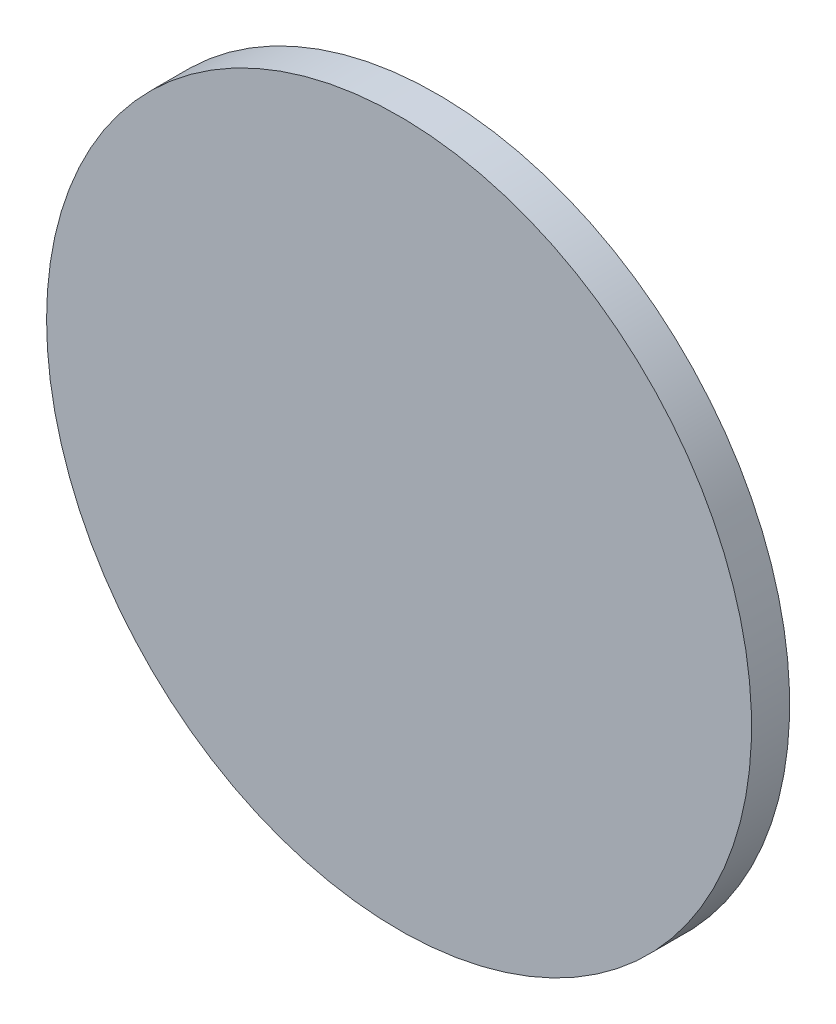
ISO-10303-21;
HEADER;
FILE_DESCRIPTION(('STEP AP214'),'2;1');
FILE_NAME('part.step','',(''),(''),'','','');
FILE_SCHEMA(('AUTOMOTIVE_DESIGN { 1 0 10303 214 1 1 1 1 }'));
ENDSEC;
DATA;
#1=APPLICATION_CONTEXT('core data for automotive mechanical design processes');
#2=APPLICATION_PROTOCOL_DEFINITION('international standard','automotive_design',2000,#1);
#3=PRODUCT_CONTEXT('',#1,'mechanical');
#4=PRODUCT('Part','Part','',(#3));
#5=PRODUCT_RELATED_PRODUCT_CATEGORY('part','',(#4));
#6=PRODUCT_DEFINITION_FORMATION('','',#4);
#7=PRODUCT_DEFINITION_CONTEXT('part definition',#1,'design');
#8=PRODUCT_DEFINITION('design','',#6,#7);
#9=PRODUCT_DEFINITION_SHAPE('','',#8);
#10=(LENGTH_UNIT() NAMED_UNIT(*) SI_UNIT(.MILLI.,.METRE.));
#11=(NAMED_UNIT(*) PLANE_ANGLE_UNIT() SI_UNIT($,.RADIAN.));
#12=(NAMED_UNIT(*) SI_UNIT($,.STERADIAN.) SOLID_ANGLE_UNIT());
#13=UNCERTAINTY_MEASURE_WITH_UNIT(LENGTH_MEASURE(1.E-05),#10,'distance_accuracy_value','');
#14=(GEOMETRIC_REPRESENTATION_CONTEXT(3) GLOBAL_UNCERTAINTY_ASSIGNED_CONTEXT((#13)) GLOBAL_UNIT_ASSIGNED_CONTEXT((#10,
#11,#12)) REPRESENTATION_CONTEXT('',''));
#15=CARTESIAN_POINT('',(0.,0.,0.));
#16=DIRECTION('',(0.,0.,1.));
#17=DIRECTION('',(1.,0.,0.));
#18=AXIS2_PLACEMENT_3D('',#15,#16,#17);
#19=CARTESIAN_POINT('',(645.5,-130.,-73.05));
#20=DIRECTION('',(-1.,0.,0.));
#21=DIRECTION('',(0.,0.,1.));
#22=AXIS2_PLACEMENT_3D('',#19,#20,#21);
#23=PLANE('',#22);
#24=DIRECTION('',(0.,0.,-1.));
#25=VECTOR('',#24,1.);
#26=CARTESIAN_POINT('',(645.5,-129.,-73.0499999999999));
#27=LINE('',#26,#25);
#28=CARTESIAN_POINT('',(645.5,-129.,-72.2817263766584));
#29=VERTEX_POINT('',#28);
#30=CARTESIAN_POINT('',(645.5,-129.,-69.9));
#31=VERTEX_POINT('',#30);
#32=EDGE_CURVE('E92',#29,#31,#27,.F.);
#33=ORIENTED_EDGE('',*,*,#32,.F.);
#34=CARTESIAN_POINT('',(645.5,-129.,-72.2817263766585));
#35=CARTESIAN_POINT('',(645.5,-129.333333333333,-72.2900525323));
#36=CARTESIAN_POINT('',(645.5,-129.666666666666,-72.2942156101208));
#37=CARTESIAN_POINT('',(645.5,-130.333333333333,-72.2942156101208));
#38=CARTESIAN_POINT('',(645.5,-130.666666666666,-72.2900525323));
#39=CARTESIAN_POINT('',(645.5,-131.,-72.2817263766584));
#40=B_SPLINE_CURVE_WITH_KNOTS('',3,(#34,#35,#36,#37,#38,#39),.UNSPECIFIED.,.F.,.F.,(4,2,4),(0.,
1.00007798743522,2.00015597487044),.UNSPECIFIED.);
#41=CARTESIAN_POINT('',(645.5,-131.,-72.2817263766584));
#42=VERTEX_POINT('',#41);
#43=EDGE_CURVE('E161',#29,#42,#40,.T.);
#44=ORIENTED_EDGE('',*,*,#43,.T.);
#45=DIRECTION('',(0.,0.,1.));
#46=VECTOR('',#45,1.);
#47=CARTESIAN_POINT('',(645.5,-131.,-73.05));
#48=LINE('',#47,#46);
#49=CARTESIAN_POINT('',(645.5,-131.,-69.9));
#50=VERTEX_POINT('',#49);
#51=EDGE_CURVE('E75',#50,#42,#48,.F.);
#52=ORIENTED_EDGE('',*,*,#51,.F.);
#53=DIRECTION('',(0.,1.,0.));
#54=VECTOR('',#53,1.);
#55=CARTESIAN_POINT('',(645.5,-130.,-69.9));
#56=LINE('',#55,#54);
#57=EDGE_CURVE('E67',#31,#50,#56,.F.);
#58=ORIENTED_EDGE('',*,*,#57,.F.);
#59=EDGE_LOOP('',(#33,#44,#52,#58));
#60=FACE_BOUND('',#59,.T.);
#61=ADVANCED_FACE('F16',(#60),#23,.T.);
#62=CARTESIAN_POINT('',(633.,-130.,-69.9));
#63=DIRECTION('',(0.,0.,-1.));
#64=DIRECTION('',(-1.,0.,0.));
#65=AXIS2_PLACEMENT_3D('',#62,#63,#64);
#66=PLANE('',#65);
#67=DIRECTION('',(0.,1.,0.));
#68=VECTOR('',#67,1.);
#69=CARTESIAN_POINT('',(620.5,-130.,-69.9000000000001));
#70=LINE('',#69,#68);
#71=CARTESIAN_POINT('',(620.5,-129.,-69.9));
#72=VERTEX_POINT('',#71);
#73=CARTESIAN_POINT('',(620.5,-131.,-69.9000000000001));
#74=VERTEX_POINT('',#73);
#75=EDGE_CURVE('E57',#72,#74,#70,.F.);
#76=ORIENTED_EDGE('',*,*,#75,.F.);
#77=DIRECTION('',(1.,0.,0.));
#78=VECTOR('',#77,1.);
#79=CARTESIAN_POINT('',(633.,-129.,-69.9000000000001));
#80=LINE('',#79,#78);
#81=EDGE_CURVE('E89',#31,#72,#80,.F.);
#82=ORIENTED_EDGE('',*,*,#81,.F.);
#83=ORIENTED_EDGE('',*,*,#57,.T.);
#84=DIRECTION('',(1.,0.,0.));
#85=VECTOR('',#84,1.);
#86=CARTESIAN_POINT('',(633.,-131.,-69.9000000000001));
#87=LINE('',#86,#85);
#88=EDGE_CURVE('E70',#74,#50,#87,.T.);
#89=ORIENTED_EDGE('',*,*,#88,.F.);
#90=EDGE_LOOP('',(#76,#82,#83,#89));
#91=FACE_BOUND('',#90,.T.);
#92=ADVANCED_FACE('F71',(#91),#66,.T.);
#93=CARTESIAN_POINT('',(620.5,-130.,-73.05));
#94=DIRECTION('',(1.,0.,0.));
#95=DIRECTION('',(0.,0.,-1.));
#96=AXIS2_PLACEMENT_3D('',#93,#94,#95);
#97=PLANE('',#96);
#98=DIRECTION('',(0.,0.,1.));
#99=VECTOR('',#98,1.);
#100=CARTESIAN_POINT('',(620.5,-131.,-73.05));
#101=LINE('',#100,#99);
#102=CARTESIAN_POINT('',(620.5,-131.,-72.2817263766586));
#103=VERTEX_POINT('',#102);
#104=EDGE_CURVE('E61',#103,#74,#101,.T.);
#105=ORIENTED_EDGE('',*,*,#104,.F.);
#106=CARTESIAN_POINT('',(620.5,-131.,-72.2817263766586));
#107=CARTESIAN_POINT('',(620.5,-130.666666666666,-72.2900525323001));
#108=CARTESIAN_POINT('',(620.5,-130.333333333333,-72.2942156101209));
#109=CARTESIAN_POINT('',(620.5,-129.666666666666,-72.2942156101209));
#110=CARTESIAN_POINT('',(620.5,-129.333333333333,-72.2900525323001));
#111=CARTESIAN_POINT('',(620.5,-129.,-72.2817263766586));
#112=B_SPLINE_CURVE_WITH_KNOTS('',3,(#106,#107,#108,#109,#110,#111),.UNSPECIFIED.,.F.,.F.,(4,2,
4),(0.,1.00007798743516,2.00015597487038),.UNSPECIFIED.);
#113=CARTESIAN_POINT('',(620.5,-129.,-72.2817263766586));
#114=VERTEX_POINT('',#113);
#115=EDGE_CURVE('E40',#103,#114,#112,.T.);
#116=ORIENTED_EDGE('',*,*,#115,.T.);
#117=DIRECTION('',(0.,0.,-1.));
#118=VECTOR('',#117,1.);
#119=CARTESIAN_POINT('',(620.5,-129.,-73.05));
#120=LINE('',#119,#118);
#121=EDGE_CURVE('E63',#72,#114,#120,.T.);
#122=ORIENTED_EDGE('',*,*,#121,.F.);
#123=ORIENTED_EDGE('',*,*,#75,.T.);
#124=EDGE_LOOP('',(#105,#116,#122,#123));
#125=FACE_BOUND('',#124,.T.);
#126=ADVANCED_FACE('F59',(#125),#97,.T.);
#127=CARTESIAN_POINT('',(633.,-131.,-73.05));
#128=DIRECTION('',(0.,1.,0.));
#129=DIRECTION('',(0.,0.,1.));
#130=AXIS2_PLACEMENT_3D('',#127,#128,#129);
#131=PLANE('',#130);
#132=ORIENTED_EDGE('',*,*,#88,.T.);
#133=ORIENTED_EDGE('',*,*,#51,.T.);
#134=CARTESIAN_POINT('',(620.5,-131.,-72.2817263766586));
#135=CARTESIAN_POINT('',(621.259636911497,-131.,-72.5189728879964));
#136=CARTESIAN_POINT('',(622.026038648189,-131.,-72.7345447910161));
#137=CARTESIAN_POINT('',(623.56991982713,-131.,-73.1217677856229));
#138=CARTESIAN_POINT('',(624.347400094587,-131.,-73.2934155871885));
#139=CARTESIAN_POINT('',(625.910898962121,-131.,-73.5921882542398));
#140=CARTESIAN_POINT('',(626.696917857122,-131.,-73.7193115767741));
#141=CARTESIAN_POINT('',(628.255340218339,-131.,-73.926026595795));
#142=CARTESIAN_POINT('',(629.027597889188,-131.,-74.0067189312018));
#143=CARTESIAN_POINT('',(630.575319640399,-131.,-74.1251146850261));
#144=CARTESIAN_POINT('',(631.350783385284,-131.,-74.1628224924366));
#145=CARTESIAN_POINT('',(632.902495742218,-131.,-74.1951430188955));
#146=CARTESIAN_POINT('',(633.678744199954,-131.,-74.1897630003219));
#147=CARTESIAN_POINT('',(635.071991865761,-131.,-74.141420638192));
#148=CARTESIAN_POINT('',(635.689276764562,-131.,-74.1063228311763));
#149=CARTESIAN_POINT('',(636.921638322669,-131.,-74.008878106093));
#150=CARTESIAN_POINT('',(637.536715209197,-131.,-73.9465340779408));
#151=CARTESIAN_POINT('',(638.763479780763,-131.,-73.7947224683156));
#152=CARTESIAN_POINT('',(639.375167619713,-131.,-73.70525612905));
#153=CARTESIAN_POINT('',(640.606340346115,-131.,-73.4972884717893));
#154=CARTESIAN_POINT('',(641.225732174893,-131.,-73.3782357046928));
#155=CARTESIAN_POINT('',(642.4585587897,-131.,-73.1123077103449));
#156=CARTESIAN_POINT('',(643.071993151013,-131.,-72.9654305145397));
#157=CARTESIAN_POINT('',(644.291701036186,-131.,-72.6441474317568));
#158=CARTESIAN_POINT('',(644.897973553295,-131.,-72.469737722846));
#159=CARTESIAN_POINT('',(645.5,-131.,-72.2817263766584));
#160=B_SPLINE_CURVE_WITH_KNOTS('',3,(#134,#135,#136,#137,#138,#139,#140,#141,#142,#143,#144,
#145,#146,#147,#148,#149,#150,#151,#152,#153,#154,#155,#156,#157,#158,#159),.UNSPECIFIED.,.F.,
.F.,(4,2,2,2,2,2,2,2,2,2,2,2,4),(0.,2.38714013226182,4.77445901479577,7.16186061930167,
9.49005231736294,11.8180062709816,14.1455678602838,15.999837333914,17.8539101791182,
19.7078981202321,21.599442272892,23.4911203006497,25.3830611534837),.UNSPECIFIED.);
#161=EDGE_CURVE('E79',#103,#42,#160,.T.);
#162=ORIENTED_EDGE('',*,*,#161,.F.);
#163=ORIENTED_EDGE('',*,*,#104,.T.);
#164=EDGE_LOOP('',(#132,#133,#162,#163));
#165=FACE_BOUND('',#164,.T.);
#166=ADVANCED_FACE('F77',(#165),#131,.T.);
#167=CARTESIAN_POINT('',(633.,-129.,-73.05));
#168=DIRECTION('',(0.,-1.,0.));
#169=DIRECTION('',(0.,0.,-1.));
#170=AXIS2_PLACEMENT_3D('',#167,#168,#169);
#171=PLANE('',#170);
#172=ORIENTED_EDGE('',*,*,#81,.T.);
#173=ORIENTED_EDGE('',*,*,#121,.T.);
#174=CARTESIAN_POINT('',(645.5,-129.,-72.2817263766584));
#175=CARTESIAN_POINT('',(644.740363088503,-129.,-72.5189728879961));
#176=CARTESIAN_POINT('',(643.973961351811,-129.,-72.7345447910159));
#177=CARTESIAN_POINT('',(642.43008017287,-129.,-73.1217677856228));
#178=CARTESIAN_POINT('',(641.652599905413,-129.,-73.2934155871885));
#179=CARTESIAN_POINT('',(640.08910103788,-129.,-73.5921882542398));
#180=CARTESIAN_POINT('',(639.303082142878,-129.,-73.719311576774));
#181=CARTESIAN_POINT('',(637.744659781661,-129.,-73.9260265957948));
#182=CARTESIAN_POINT('',(636.972402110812,-129.,-74.0067189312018));
#183=CARTESIAN_POINT('',(635.424680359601,-129.,-74.1251146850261));
#184=CARTESIAN_POINT('',(634.649216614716,-129.,-74.1628224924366));
#185=CARTESIAN_POINT('',(633.097504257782,-129.,-74.1951430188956));
#186=CARTESIAN_POINT('',(632.321255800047,-129.,-74.189763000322));
#187=CARTESIAN_POINT('',(630.928008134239,-129.,-74.1414206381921));
#188=CARTESIAN_POINT('',(630.310723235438,-129.,-74.1063228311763));
#189=CARTESIAN_POINT('',(629.078361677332,-129.,-74.008878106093));
#190=CARTESIAN_POINT('',(628.463284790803,-129.,-73.9465340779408));
#191=CARTESIAN_POINT('',(627.236520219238,-129.,-73.7947224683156));
#192=CARTESIAN_POINT('',(626.624832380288,-129.,-73.70525612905));
#193=CARTESIAN_POINT('',(625.393659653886,-129.,-73.4972884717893));
#194=CARTESIAN_POINT('',(624.774267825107,-129.,-73.3782357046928));
#195=CARTESIAN_POINT('',(623.5414412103,-129.,-73.112307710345));
#196=CARTESIAN_POINT('',(622.928006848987,-129.,-72.9654305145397));
#197=CARTESIAN_POINT('',(621.708298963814,-129.,-72.6441474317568));
#198=CARTESIAN_POINT('',(621.102026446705,-129.,-72.469737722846));
#199=CARTESIAN_POINT('',(620.5,-129.,-72.2817263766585));
#200=B_SPLINE_CURVE_WITH_KNOTS('',3,(#174,#175,#176,#177,#178,#179,#180,#181,#182,#183,#184,
#185,#186,#187,#188,#189,#190,#191,#192,#193,#194,#195,#196,#197,#198,#199),.UNSPECIFIED.,.F.,
.F.,(4,2,2,2,2,2,2,2,2,2,2,2,4),(0.,2.38714013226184,4.77445901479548,7.1618606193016,
9.49005231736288,11.8180062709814,14.1455678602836,15.9998373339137,17.853910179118,
19.7078981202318,21.5994422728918,23.4911203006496,25.3830611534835),.UNSPECIFIED.);
#201=EDGE_CURVE('E120',#29,#114,#200,.T.);
#202=ORIENTED_EDGE('',*,*,#201,.F.);
#203=ORIENTED_EDGE('',*,*,#32,.T.);
#204=EDGE_LOOP('',(#172,#173,#202,#203));
#205=FACE_BOUND('',#204,.T.);
#206=ADVANCED_FACE('F103',(#205),#171,.T.);
#207=CARTESIAN_POINT('',(633.,-130.,-32.253488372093));
#208=DIRECTION('',(0.0499067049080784,0.807563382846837,0.587665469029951));
#209=DIRECTION('',(0.783620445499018,-0.396470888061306,0.478277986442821));
#210=AXIS2_PLACEMENT_3D('',#207,#208,#209);
#211=SPHERICAL_SURFACE('',#210,41.946511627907);
#212=ORIENTED_EDGE('',*,*,#161,.T.);
#213=ORIENTED_EDGE('',*,*,#43,.F.);
#214=ORIENTED_EDGE('',*,*,#201,.T.);
#215=ORIENTED_EDGE('',*,*,#115,.F.);
#216=EDGE_LOOP('',(#212,#213,#214,#215));
#217=FACE_BOUND('',#216,.T.);
#218=CARTESIAN_POINT('',(633.,-130.,-69.9));
#219=DIRECTION('',(0.,0.,-1.));
#220=DIRECTION('',(-1.,0.,0.));
#221=AXIS2_PLACEMENT_3D('',#218,#219,#220);
#222=CIRCLE('',#221,18.5);
#223=CARTESIAN_POINT('',(614.5,-130.,-69.9));
#224=VERTEX_POINT('',#223);
#225=EDGE_CURVE('E31',#224,#224,#222,.F.);
#226=ORIENTED_EDGE('',*,*,#225,.F.);
#227=EDGE_LOOP('',(#226));
#228=FACE_BOUND('',#227,.T.);
#229=ADVANCED_FACE('F106',(#217,#228),#211,.T.);
#230=CARTESIAN_POINT('',(633.,-130.,-68.9));
#231=DIRECTION('',(0.,0.,-1.));
#232=DIRECTION('',(-1.,0.,0.));
#233=AXIS2_PLACEMENT_3D('',#230,#231,#232);
#234=CYLINDRICAL_SURFACE('',#233,18.5);
#235=ORIENTED_EDGE('',*,*,#225,.T.);
#236=EDGE_LOOP('',(#235));
#237=FACE_BOUND('',#236,.T.);
#238=CARTESIAN_POINT('',(633.,-130.,-67.9));
#239=DIRECTION('',(0.,0.,-1.));
#240=DIRECTION('',(-1.,0.,0.));
#241=AXIS2_PLACEMENT_3D('',#238,#239,#240);
#242=CIRCLE('',#241,18.5);
#243=CARTESIAN_POINT('',(614.5,-130.,-67.9));
#244=VERTEX_POINT('',#243);
#245=EDGE_CURVE('E11',#244,#244,#242,.F.);
#246=ORIENTED_EDGE('',*,*,#245,.F.);
#247=EDGE_LOOP('',(#246));
#248=FACE_BOUND('',#247,.T.);
#249=ADVANCED_FACE('F139',(#237,#248),#234,.T.);
#250=CARTESIAN_POINT('',(642.25,-130.,-67.9));
#251=DIRECTION('',(0.,0.,1.));
#252=DIRECTION('',(1.,0.,0.));
#253=AXIS2_PLACEMENT_3D('',#250,#251,#252);
#254=PLANE('',#253);
#255=ORIENTED_EDGE('',*,*,#245,.T.);
#256=EDGE_LOOP('',(#255));
#257=FACE_BOUND('',#256,.T.);
#258=ADVANCED_FACE('F18',(#257),#254,.T.);
#259=CLOSED_SHELL('',(#61,#92,#126,#166,#206,#229,#249,#258));
#260=MANIFOLD_SOLID_BREP('B1',#259);
#261=ADVANCED_BREP_SHAPE_REPRESENTATION('',(#18,#260),#14);
#262=SHAPE_DEFINITION_REPRESENTATION(#9,#261);
ENDSEC;
END-ISO-10303-21;
